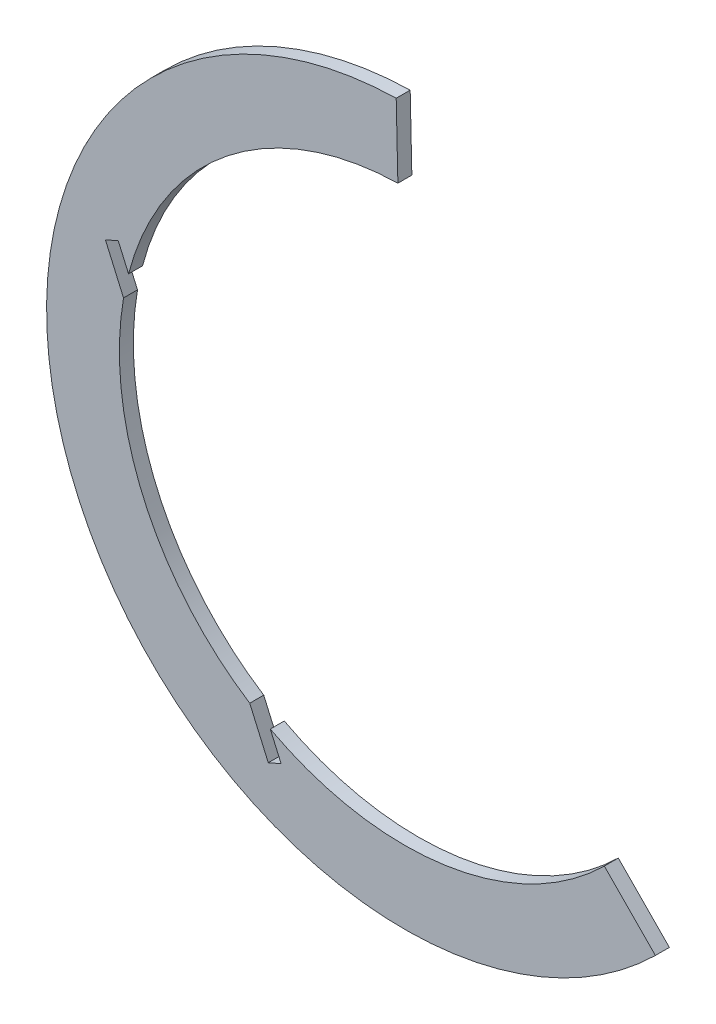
ISO-10303-21;
HEADER;
FILE_DESCRIPTION(('STEP AP214'),'2;1');
FILE_NAME('part.step','',(''),(''),'','','');
FILE_SCHEMA(('AUTOMOTIVE_DESIGN { 1 0 10303 214 1 1 1 1 }'));
ENDSEC;
DATA;
#1=APPLICATION_CONTEXT('core data for automotive mechanical design processes');
#2=APPLICATION_PROTOCOL_DEFINITION('international standard','automotive_design',2000,#1);
#3=PRODUCT_CONTEXT('',#1,'mechanical');
#4=PRODUCT('Part','Part','',(#3));
#5=PRODUCT_RELATED_PRODUCT_CATEGORY('part','',(#4));
#6=PRODUCT_DEFINITION_FORMATION('','',#4);
#7=PRODUCT_DEFINITION_CONTEXT('part definition',#1,'design');
#8=PRODUCT_DEFINITION('design','',#6,#7);
#9=PRODUCT_DEFINITION_SHAPE('','',#8);
#10=(LENGTH_UNIT() NAMED_UNIT(*) SI_UNIT(.MILLI.,.METRE.));
#11=(NAMED_UNIT(*) PLANE_ANGLE_UNIT() SI_UNIT($,.RADIAN.));
#12=(NAMED_UNIT(*) SI_UNIT($,.STERADIAN.) SOLID_ANGLE_UNIT());
#13=UNCERTAINTY_MEASURE_WITH_UNIT(LENGTH_MEASURE(1.E-05),#10,'distance_accuracy_value','');
#14=(GEOMETRIC_REPRESENTATION_CONTEXT(3) GLOBAL_UNCERTAINTY_ASSIGNED_CONTEXT((#13)) GLOBAL_UNIT_ASSIGNED_CONTEXT((#10,
#11,#12)) REPRESENTATION_CONTEXT('',''));
#15=CARTESIAN_POINT('',(0.,0.,0.));
#16=DIRECTION('',(0.,0.,1.));
#17=DIRECTION('',(1.,0.,0.));
#18=AXIS2_PLACEMENT_3D('',#15,#16,#17);
#19=CARTESIAN_POINT('',(-59.4513471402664,-35.0203729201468,1.524));
#20=DIRECTION('',(0.,0.,-1.));
#21=DIRECTION('',(-1.,0.,0.));
#22=AXIS2_PLACEMENT_3D('',#19,#20,#21);
#23=CYLINDRICAL_SURFACE('',#22,39.0171166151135);
#24=CARTESIAN_POINT('',(-59.4513471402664,-35.0203729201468,0.));
#25=DIRECTION('',(0.,0.,1.));
#26=DIRECTION('',(1.,0.,0.));
#27=AXIS2_PLACEMENT_3D('',#24,#25,#26);
#28=CIRCLE('',#27,39.0171166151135);
#29=CARTESIAN_POINT('',(-60.3472245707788,3.98645715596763,0.));
#30=VERTEX_POINT('',#29);
#31=CARTESIAN_POINT('',(-32.0859224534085,-62.8316821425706,0.));
#32=VERTEX_POINT('',#31);
#33=EDGE_CURVE('E154',#30,#32,#28,.T.);
#34=ORIENTED_EDGE('',*,*,#33,.T.);
#35=DIRECTION('',(0.,0.,-1.));
#36=VECTOR('',#35,1.);
#37=CARTESIAN_POINT('',(-32.0859224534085,-62.8316821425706,1.524));
#38=LINE('',#37,#36);
#39=CARTESIAN_POINT('',(-32.0859224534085,-62.8316821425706,1.524));
#40=VERTEX_POINT('',#39);
#41=EDGE_CURVE('E11',#40,#32,#38,.T.);
#42=ORIENTED_EDGE('',*,*,#41,.F.);
#43=CARTESIAN_POINT('',(-59.4513471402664,-35.0203729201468,1.524));
#44=DIRECTION('',(0.,0.,1.));
#45=DIRECTION('',(1.,0.,0.));
#46=AXIS2_PLACEMENT_3D('',#43,#44,#45);
#47=CIRCLE('',#46,39.0171166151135);
#48=CARTESIAN_POINT('',(-60.3472245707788,3.98645715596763,1.524));
#49=VERTEX_POINT('',#48);
#50=EDGE_CURVE('E176',#49,#40,#47,.T.);
#51=ORIENTED_EDGE('',*,*,#50,.F.);
#52=DIRECTION('',(0.,0.,-1.));
#53=VECTOR('',#52,1.);
#54=CARTESIAN_POINT('',(-60.3472245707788,3.98645715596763,1.524));
#55=LINE('',#54,#53);
#56=EDGE_CURVE('E150',#49,#30,#55,.T.);
#57=ORIENTED_EDGE('',*,*,#56,.T.);
#58=EDGE_LOOP('',(#34,#42,#51,#57));
#59=FACE_BOUND('',#58,.T.);
#60=ADVANCED_FACE('F34',(#59),#23,.T.);
#61=CARTESIAN_POINT('',(-37.6530447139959,-57.1738507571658,1.524));
#62=DIRECTION('',(-0.712797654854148,-0.701369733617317,0.));
#63=DIRECTION('',(0.701369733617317,-0.712797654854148,0.));
#64=AXIS2_PLACEMENT_3D('',#61,#62,#63);
#65=PLANE('',#64);
#66=DIRECTION('',(-0.701369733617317,0.712797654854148,0.));
#67=VECTOR('',#66,1.);
#68=CARTESIAN_POINT('',(-37.6530447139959,-57.1738507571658,0.));
#69=LINE('',#68,#67);
#70=CARTESIAN_POINT('',(-37.6530447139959,-57.1738507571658,0.));
#71=VERTEX_POINT('',#70);
#72=EDGE_CURVE('E157',#32,#71,#69,.T.);
#73=ORIENTED_EDGE('',*,*,#72,.T.);
#74=DIRECTION('',(0.,0.,-1.));
#75=VECTOR('',#74,1.);
#76=CARTESIAN_POINT('',(-37.6530447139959,-57.1738507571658,1.524));
#77=LINE('',#76,#75);
#78=CARTESIAN_POINT('',(-37.6530447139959,-57.1738507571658,1.524));
#79=VERTEX_POINT('',#78);
#80=EDGE_CURVE('E42',#79,#71,#77,.T.);
#81=ORIENTED_EDGE('',*,*,#80,.F.);
#82=DIRECTION('',(-0.701369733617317,0.712797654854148,0.));
#83=VECTOR('',#82,1.);
#84=CARTESIAN_POINT('',(-37.6530447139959,-57.1738507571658,1.524));
#85=LINE('',#84,#83);
#86=EDGE_CURVE('E105',#40,#79,#85,.T.);
#87=ORIENTED_EDGE('',*,*,#86,.F.);
#88=ORIENTED_EDGE('',*,*,#41,.T.);
#89=EDGE_LOOP('',(#73,#81,#87,#88));
#90=FACE_BOUND('',#89,.T.);
#91=ADVANCED_FACE('F254',(#90),#65,.F.);
#92=CARTESIAN_POINT('',(-59.4513471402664,-35.0203729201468,1.524));
#93=DIRECTION('',(0.,0.,-1.));
#94=DIRECTION('',(-1.,0.,0.));
#95=AXIS2_PLACEMENT_3D('',#92,#93,#94);
#96=CYLINDRICAL_SURFACE('',#95,31.0796166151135);
#97=CARTESIAN_POINT('',(-59.4513471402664,-35.0203729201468,0.));
#98=DIRECTION('',(0.,0.,-1.));
#99=DIRECTION('',(1.,0.,0.));
#100=AXIS2_PLACEMENT_3D('',#97,#98,#99);
#101=CIRCLE('',#100,31.0796166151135);
#102=CARTESIAN_POINT('',(-74.0741041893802,-62.4451344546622,0.));
#103=VERTEX_POINT('',#102);
#104=EDGE_CURVE('E159',#71,#103,#101,.T.);
#105=ORIENTED_EDGE('',*,*,#104,.T.);
#106=DIRECTION('',(0.,0.,-1.));
#107=VECTOR('',#106,1.);
#108=CARTESIAN_POINT('',(-74.0741041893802,-62.4451344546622,1.524));
#109=LINE('',#108,#107);
#110=CARTESIAN_POINT('',(-74.0741041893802,-62.4451344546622,1.524));
#111=VERTEX_POINT('',#110);
#112=EDGE_CURVE('E195',#111,#103,#109,.T.);
#113=ORIENTED_EDGE('',*,*,#112,.F.);
#114=CARTESIAN_POINT('',(-59.4513471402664,-35.0203729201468,1.524));
#115=DIRECTION('',(0.,0.,-1.));
#116=DIRECTION('',(1.,0.,0.));
#117=AXIS2_PLACEMENT_3D('',#114,#115,#116);
#118=CIRCLE('',#117,31.0796166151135);
#119=EDGE_CURVE('E203',#79,#111,#118,.T.);
#120=ORIENTED_EDGE('',*,*,#119,.F.);
#121=ORIENTED_EDGE('',*,*,#80,.T.);
#122=EDGE_LOOP('',(#105,#113,#120,#121));
#123=FACE_BOUND('',#122,.T.);
#124=ADVANCED_FACE('F201',(#123),#96,.F.);
#125=CARTESIAN_POINT('',(-72.898676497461,-65.1259343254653,1.524));
#126=DIRECTION('',(0.915833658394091,0.401557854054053,0.));
#127=DIRECTION('',(-0.401557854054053,0.915833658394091,0.));
#128=AXIS2_PLACEMENT_3D('',#125,#126,#127);
#129=PLANE('',#128);
#130=DIRECTION('',(0.401557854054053,-0.915833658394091,0.));
#131=VECTOR('',#130,1.);
#132=CARTESIAN_POINT('',(-72.898676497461,-65.1259343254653,0.));
#133=LINE('',#132,#131);
#134=CARTESIAN_POINT('',(-72.898676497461,-65.1259343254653,0.));
#135=VERTEX_POINT('',#134);
#136=EDGE_CURVE('E161',#103,#135,#133,.T.);
#137=ORIENTED_EDGE('',*,*,#136,.T.);
#138=DIRECTION('',(0.,0.,-1.));
#139=VECTOR('',#138,1.);
#140=CARTESIAN_POINT('',(-72.898676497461,-65.1259343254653,1.524));
#141=LINE('',#140,#139);
#142=CARTESIAN_POINT('',(-72.898676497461,-65.1259343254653,1.524));
#143=VERTEX_POINT('',#142);
#144=EDGE_CURVE('E192',#143,#135,#141,.T.);
#145=ORIENTED_EDGE('',*,*,#144,.F.);
#146=DIRECTION('',(0.401557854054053,-0.915833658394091,0.));
#147=VECTOR('',#146,1.);
#148=CARTESIAN_POINT('',(-72.898676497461,-65.1259343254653,1.524));
#149=LINE('',#148,#147);
#150=EDGE_CURVE('E221',#111,#143,#149,.T.);
#151=ORIENTED_EDGE('',*,*,#150,.F.);
#152=ORIENTED_EDGE('',*,*,#112,.T.);
#153=EDGE_LOOP('',(#137,#145,#151,#152));
#154=FACE_BOUND('',#153,.T.);
#155=ADVANCED_FACE('F212',(#154),#129,.F.);
#156=CARTESIAN_POINT('',(-74.2944069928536,-65.7379084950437,1.524));
#157=DIRECTION('',(0.401557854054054,-0.91583365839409,0.));
#158=DIRECTION('',(0.91583365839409,0.401557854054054,0.));
#159=AXIS2_PLACEMENT_3D('',#156,#157,#158);
#160=PLANE('',#159);
#161=DIRECTION('',(-0.91583365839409,-0.401557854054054,0.));
#162=VECTOR('',#161,1.);
#163=CARTESIAN_POINT('',(-74.2944069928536,-65.7379084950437,0.));
#164=LINE('',#163,#162);
#165=CARTESIAN_POINT('',(-74.2944069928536,-65.7379084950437,0.));
#166=VERTEX_POINT('',#165);
#167=EDGE_CURVE('E163',#135,#166,#164,.T.);
#168=ORIENTED_EDGE('',*,*,#167,.T.);
#169=DIRECTION('',(0.,0.,-1.));
#170=VECTOR('',#169,1.);
#171=CARTESIAN_POINT('',(-74.2944069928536,-65.7379084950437,1.524));
#172=LINE('',#171,#170);
#173=CARTESIAN_POINT('',(-74.2944069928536,-65.7379084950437,1.524));
#174=VERTEX_POINT('',#173);
#175=EDGE_CURVE('E189',#174,#166,#172,.T.);
#176=ORIENTED_EDGE('',*,*,#175,.F.);
#177=DIRECTION('',(-0.91583365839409,-0.401557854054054,0.));
#178=VECTOR('',#177,1.);
#179=CARTESIAN_POINT('',(-74.2944069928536,-65.7379084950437,1.524));
#180=LINE('',#179,#178);
#181=EDGE_CURVE('E218',#143,#174,#180,.T.);
#182=ORIENTED_EDGE('',*,*,#181,.F.);
#183=ORIENTED_EDGE('',*,*,#144,.T.);
#184=EDGE_LOOP('',(#168,#176,#182,#183));
#185=FACE_BOUND('',#184,.T.);
#186=ADVANCED_FACE('F216',(#185),#160,.F.);
#187=CARTESIAN_POINT('',(-76.3165084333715,-61.1260984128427,1.524));
#188=DIRECTION('',(-0.915833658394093,-0.401557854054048,0.));
#189=DIRECTION('',(0.401557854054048,-0.915833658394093,0.));
#190=AXIS2_PLACEMENT_3D('',#187,#188,#189);
#191=PLANE('',#190);
#192=DIRECTION('',(-0.401557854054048,0.915833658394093,0.));
#193=VECTOR('',#192,1.);
#194=CARTESIAN_POINT('',(-76.3165084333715,-61.1260984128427,0.));
#195=LINE('',#194,#193);
#196=CARTESIAN_POINT('',(-76.3165084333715,-61.1260984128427,0.));
#197=VERTEX_POINT('',#196);
#198=EDGE_CURVE('E165',#166,#197,#195,.T.);
#199=ORIENTED_EDGE('',*,*,#198,.T.);
#200=DIRECTION('',(0.,0.,-1.));
#201=VECTOR('',#200,1.);
#202=CARTESIAN_POINT('',(-76.3165084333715,-61.1260984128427,1.524));
#203=LINE('',#202,#201);
#204=CARTESIAN_POINT('',(-76.3165084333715,-61.1260984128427,1.524));
#205=VERTEX_POINT('',#204);
#206=EDGE_CURVE('E186',#205,#197,#203,.T.);
#207=ORIENTED_EDGE('',*,*,#206,.F.);
#208=DIRECTION('',(-0.401557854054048,0.915833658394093,0.));
#209=VECTOR('',#208,1.);
#210=CARTESIAN_POINT('',(-76.3165084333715,-61.1260984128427,1.524));
#211=LINE('',#210,#209);
#212=EDGE_CURVE('E220',#174,#205,#211,.T.);
#213=ORIENTED_EDGE('',*,*,#212,.F.);
#214=ORIENTED_EDGE('',*,*,#175,.T.);
#215=EDGE_LOOP('',(#199,#207,#213,#214));
#216=FACE_BOUND('',#215,.T.);
#217=ADVANCED_FACE('F267',(#216),#191,.F.);
#218=CARTESIAN_POINT('',(-59.4513471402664,-35.0203729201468,1.524));
#219=DIRECTION('',(0.,0.,-1.));
#220=DIRECTION('',(-1.,0.,0.));
#221=AXIS2_PLACEMENT_3D('',#218,#219,#220);
#222=CYLINDRICAL_SURFACE('',#221,31.0796166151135);
#223=CARTESIAN_POINT('',(-59.4513471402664,-35.0203729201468,0.));
#224=DIRECTION('',(0.,0.,-1.));
#225=DIRECTION('',(1.,0.,0.));
#226=AXIS2_PLACEMENT_3D('',#223,#224,#225);
#227=CIRCLE('',#226,31.0796166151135);
#228=CARTESIAN_POINT('',(-90.0788310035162,-29.7383466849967,0.));
#229=VERTEX_POINT('',#228);
#230=EDGE_CURVE('E167',#197,#229,#227,.T.);
#231=ORIENTED_EDGE('',*,*,#230,.T.);
#232=DIRECTION('',(0.,0.,-1.));
#233=VECTOR('',#232,1.);
#234=CARTESIAN_POINT('',(-90.0788310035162,-29.7383466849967,1.524));
#235=LINE('',#234,#233);
#236=CARTESIAN_POINT('',(-90.0788310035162,-29.7383466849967,1.524));
#237=VERTEX_POINT('',#236);
#238=EDGE_CURVE('E183',#237,#229,#235,.T.);
#239=ORIENTED_EDGE('',*,*,#238,.F.);
#240=CARTESIAN_POINT('',(-59.4513471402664,-35.0203729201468,1.524));
#241=DIRECTION('',(0.,0.,-1.));
#242=DIRECTION('',(1.,0.,0.));
#243=AXIS2_PLACEMENT_3D('',#240,#241,#242);
#244=CIRCLE('',#243,31.0796166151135);
#245=EDGE_CURVE('E223',#205,#237,#244,.T.);
#246=ORIENTED_EDGE('',*,*,#245,.F.);
#247=ORIENTED_EDGE('',*,*,#206,.T.);
#248=EDGE_LOOP('',(#231,#239,#246,#247));
#249=FACE_BOUND('',#248,.T.);
#250=ADVANCED_FACE('F270',(#249),#222,.F.);
#251=CARTESIAN_POINT('',(-92.0512347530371,-25.2398822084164,1.524));
#252=DIRECTION('',(-0.915833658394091,-0.401557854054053,0.));
#253=DIRECTION('',(0.401557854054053,-0.915833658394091,0.));
#254=AXIS2_PLACEMENT_3D('',#251,#252,#253);
#255=PLANE('',#254);
#256=DIRECTION('',(-0.401557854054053,0.915833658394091,0.));
#257=VECTOR('',#256,1.);
#258=CARTESIAN_POINT('',(-92.0512347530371,-25.2398822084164,0.));
#259=LINE('',#258,#257);
#260=CARTESIAN_POINT('',(-92.0512347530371,-25.2398822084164,0.));
#261=VERTEX_POINT('',#260);
#262=EDGE_CURVE('E169',#229,#261,#259,.T.);
#263=ORIENTED_EDGE('',*,*,#262,.T.);
#264=DIRECTION('',(0.,0.,-1.));
#265=VECTOR('',#264,1.);
#266=CARTESIAN_POINT('',(-92.0512347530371,-25.2398822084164,1.524));
#267=LINE('',#266,#265);
#268=CARTESIAN_POINT('',(-92.0512347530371,-25.2398822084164,1.524));
#269=VERTEX_POINT('',#268);
#270=EDGE_CURVE('E180',#269,#261,#267,.T.);
#271=ORIENTED_EDGE('',*,*,#270,.F.);
#272=DIRECTION('',(-0.401557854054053,0.915833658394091,0.));
#273=VECTOR('',#272,1.);
#274=CARTESIAN_POINT('',(-92.0512347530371,-25.2398822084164,1.524));
#275=LINE('',#274,#273);
#276=EDGE_CURVE('E229',#237,#269,#275,.T.);
#277=ORIENTED_EDGE('',*,*,#276,.F.);
#278=ORIENTED_EDGE('',*,*,#238,.T.);
#279=EDGE_LOOP('',(#263,#271,#277,#278));
#280=FACE_BOUND('',#279,.T.);
#281=ADVANCED_FACE('F235',(#280),#255,.F.);
#282=CARTESIAN_POINT('',(-90.6555042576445,-24.6279080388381,1.524));
#283=DIRECTION('',(-0.401557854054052,0.915833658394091,0.));
#284=DIRECTION('',(-0.915833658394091,-0.401557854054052,0.));
#285=AXIS2_PLACEMENT_3D('',#282,#283,#284);
#286=PLANE('',#285);
#287=DIRECTION('',(0.915833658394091,0.401557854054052,0.));
#288=VECTOR('',#287,1.);
#289=CARTESIAN_POINT('',(-90.6555042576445,-24.6279080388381,0.));
#290=LINE('',#289,#288);
#291=CARTESIAN_POINT('',(-90.6555042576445,-24.6279080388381,0.));
#292=VERTEX_POINT('',#291);
#293=EDGE_CURVE('E171',#261,#292,#290,.T.);
#294=ORIENTED_EDGE('',*,*,#293,.T.);
#295=DIRECTION('',(0.,0.,-1.));
#296=VECTOR('',#295,1.);
#297=CARTESIAN_POINT('',(-90.6555042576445,-24.6279080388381,1.524));
#298=LINE('',#297,#296);
#299=CARTESIAN_POINT('',(-90.6555042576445,-24.6279080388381,1.524));
#300=VERTEX_POINT('',#299);
#301=EDGE_CURVE('E145',#300,#292,#298,.T.);
#302=ORIENTED_EDGE('',*,*,#301,.F.);
#303=DIRECTION('',(0.915833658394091,0.401557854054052,0.));
#304=VECTOR('',#303,1.);
#305=CARTESIAN_POINT('',(-90.6555042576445,-24.6279080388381,1.524));
#306=LINE('',#305,#304);
#307=EDGE_CURVE('E136',#269,#300,#306,.T.);
#308=ORIENTED_EDGE('',*,*,#307,.F.);
#309=ORIENTED_EDGE('',*,*,#270,.T.);
#310=EDGE_LOOP('',(#294,#302,#308,#309));
#311=FACE_BOUND('',#310,.T.);
#312=ADVANCED_FACE('F239',(#311),#286,.F.);
#313=CARTESIAN_POINT('',(-89.5297742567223,-27.1953623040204,1.524));
#314=DIRECTION('',(0.915833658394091,0.401557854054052,0.));
#315=DIRECTION('',(-0.401557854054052,0.915833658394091,0.));
#316=AXIS2_PLACEMENT_3D('',#313,#314,#315);
#317=PLANE('',#316);
#318=DIRECTION('',(0.401557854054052,-0.915833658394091,0.));
#319=VECTOR('',#318,1.);
#320=CARTESIAN_POINT('',(-89.5297742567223,-27.1953623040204,0.));
#321=LINE('',#320,#319);
#322=CARTESIAN_POINT('',(-89.5297742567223,-27.1953623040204,0.));
#323=VERTEX_POINT('',#322);
#324=EDGE_CURVE('E144',#292,#323,#321,.T.);
#325=ORIENTED_EDGE('',*,*,#324,.T.);
#326=DIRECTION('',(0.,0.,-1.));
#327=VECTOR('',#326,1.);
#328=CARTESIAN_POINT('',(-89.5297742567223,-27.1953623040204,1.524));
#329=LINE('',#328,#327);
#330=CARTESIAN_POINT('',(-89.5297742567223,-27.1953623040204,1.524));
#331=VERTEX_POINT('',#330);
#332=EDGE_CURVE('E141',#331,#323,#329,.T.);
#333=ORIENTED_EDGE('',*,*,#332,.F.);
#334=DIRECTION('',(0.401557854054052,-0.915833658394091,0.));
#335=VECTOR('',#334,1.);
#336=CARTESIAN_POINT('',(-89.5297742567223,-27.1953623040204,1.524));
#337=LINE('',#336,#335);
#338=EDGE_CURVE('E130',#300,#331,#337,.T.);
#339=ORIENTED_EDGE('',*,*,#338,.F.);
#340=ORIENTED_EDGE('',*,*,#301,.T.);
#341=EDGE_LOOP('',(#325,#333,#339,#340));
#342=FACE_BOUND('',#341,.T.);
#343=ADVANCED_FACE('F142',(#342),#317,.F.);
#344=CARTESIAN_POINT('',(-59.4513471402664,-35.0203729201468,1.524));
#345=DIRECTION('',(0.,0.,-1.));
#346=DIRECTION('',(-1.,0.,0.));
#347=AXIS2_PLACEMENT_3D('',#344,#345,#346);
#348=CYLINDRICAL_SURFACE('',#347,31.0796166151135);
#349=CARTESIAN_POINT('',(-59.4513471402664,-35.0203729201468,0.));
#350=DIRECTION('',(0.,0.,-1.));
#351=DIRECTION('',(1.,0.,0.));
#352=AXIS2_PLACEMENT_3D('',#349,#350,#351);
#353=CIRCLE('',#352,31.0796166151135);
#354=CARTESIAN_POINT('',(-60.1649705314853,-3.94895018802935,0.));
#355=VERTEX_POINT('',#354);
#356=EDGE_CURVE('E91',#323,#355,#353,.T.);
#357=ORIENTED_EDGE('',*,*,#356,.T.);
#358=DIRECTION('',(0.,0.,-1.));
#359=VECTOR('',#358,1.);
#360=CARTESIAN_POINT('',(-60.1649705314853,-3.94895018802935,1.524));
#361=LINE('',#360,#359);
#362=CARTESIAN_POINT('',(-60.1649705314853,-3.94895018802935,1.524));
#363=VERTEX_POINT('',#362);
#364=EDGE_CURVE('E146',#363,#355,#361,.T.);
#365=ORIENTED_EDGE('',*,*,#364,.F.);
#366=CARTESIAN_POINT('',(-59.4513471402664,-35.0203729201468,1.524));
#367=DIRECTION('',(0.,0.,-1.));
#368=DIRECTION('',(1.,0.,0.));
#369=AXIS2_PLACEMENT_3D('',#366,#367,#368);
#370=CIRCLE('',#369,31.0796166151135);
#371=EDGE_CURVE('E134',#331,#363,#370,.T.);
#372=ORIENTED_EDGE('',*,*,#371,.F.);
#373=ORIENTED_EDGE('',*,*,#332,.T.);
#374=EDGE_LOOP('',(#357,#365,#372,#373));
#375=FACE_BOUND('',#374,.T.);
#376=ADVANCED_FACE('F148',(#375),#348,.F.);
#377=CARTESIAN_POINT('',(-60.3472245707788,3.98645715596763,1.524));
#378=DIRECTION('',(-0.999736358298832,-0.0229611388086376,0.));
#379=DIRECTION('',(0.0229611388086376,-0.999736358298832,0.));
#380=AXIS2_PLACEMENT_3D('',#377,#378,#379);
#381=PLANE('',#380);
#382=DIRECTION('',(-0.0229611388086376,0.999736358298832,0.));
#383=VECTOR('',#382,1.);
#384=CARTESIAN_POINT('',(-60.3472245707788,3.98645715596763,0.));
#385=LINE('',#384,#383);
#386=EDGE_CURVE('E97',#355,#30,#385,.T.);
#387=ORIENTED_EDGE('',*,*,#386,.T.);
#388=ORIENTED_EDGE('',*,*,#56,.F.);
#389=DIRECTION('',(-0.0229611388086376,0.999736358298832,0.));
#390=VECTOR('',#389,1.);
#391=CARTESIAN_POINT('',(-60.3472245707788,3.98645715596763,1.524));
#392=LINE('',#391,#390);
#393=EDGE_CURVE('E50',#363,#49,#392,.T.);
#394=ORIENTED_EDGE('',*,*,#393,.F.);
#395=ORIENTED_EDGE('',*,*,#364,.T.);
#396=EDGE_LOOP('',(#387,#388,#394,#395));
#397=FACE_BOUND('',#396,.T.);
#398=ADVANCED_FACE('F243',(#397),#381,.F.);
#399=CARTESIAN_POINT('',(-59.4513471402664,-35.0203729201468,1.524));
#400=DIRECTION('',(0.,0.,1.));
#401=DIRECTION('',(1.,0.,0.));
#402=AXIS2_PLACEMENT_3D('',#399,#400,#401);
#403=PLANE('',#402);
#404=ORIENTED_EDGE('',*,*,#50,.T.);
#405=ORIENTED_EDGE('',*,*,#86,.T.);
#406=ORIENTED_EDGE('',*,*,#119,.T.);
#407=ORIENTED_EDGE('',*,*,#150,.T.);
#408=ORIENTED_EDGE('',*,*,#181,.T.);
#409=ORIENTED_EDGE('',*,*,#212,.T.);
#410=ORIENTED_EDGE('',*,*,#245,.T.);
#411=ORIENTED_EDGE('',*,*,#276,.T.);
#412=ORIENTED_EDGE('',*,*,#307,.T.);
#413=ORIENTED_EDGE('',*,*,#338,.T.);
#414=ORIENTED_EDGE('',*,*,#371,.T.);
#415=ORIENTED_EDGE('',*,*,#393,.T.);
#416=EDGE_LOOP('',(#404,#405,#406,#407,#408,#409,#410,#411,#412,#413,#414,#415));
#417=FACE_BOUND('',#416,.T.);
#418=ADVANCED_FACE('F132',(#417),#403,.T.);
#419=CARTESIAN_POINT('',(-59.4513471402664,-35.0203729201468,0.));
#420=DIRECTION('',(0.,0.,1.));
#421=DIRECTION('',(1.,0.,0.));
#422=AXIS2_PLACEMENT_3D('',#419,#420,#421);
#423=PLANE('',#422);
#424=ORIENTED_EDGE('',*,*,#33,.F.);
#425=ORIENTED_EDGE('',*,*,#386,.F.);
#426=ORIENTED_EDGE('',*,*,#356,.F.);
#427=ORIENTED_EDGE('',*,*,#324,.F.);
#428=ORIENTED_EDGE('',*,*,#293,.F.);
#429=ORIENTED_EDGE('',*,*,#262,.F.);
#430=ORIENTED_EDGE('',*,*,#230,.F.);
#431=ORIENTED_EDGE('',*,*,#198,.F.);
#432=ORIENTED_EDGE('',*,*,#167,.F.);
#433=ORIENTED_EDGE('',*,*,#136,.F.);
#434=ORIENTED_EDGE('',*,*,#104,.F.);
#435=ORIENTED_EDGE('',*,*,#72,.F.);
#436=EDGE_LOOP('',(#424,#425,#426,#427,#428,#429,#430,#431,#432,#433,#434,#435));
#437=FACE_BOUND('',#436,.T.);
#438=ADVANCED_FACE('F207',(#437),#423,.F.);
#439=CLOSED_SHELL('',(#60,#91,#124,#155,#186,#217,#250,#281,#312,#343,#376,#398,#418,#438));
#440=MANIFOLD_SOLID_BREP('B2',#439);
#441=ADVANCED_BREP_SHAPE_REPRESENTATION('',(#18,#440),#14);
#442=SHAPE_DEFINITION_REPRESENTATION(#9,#441);
ENDSEC;
END-ISO-10303-21;
